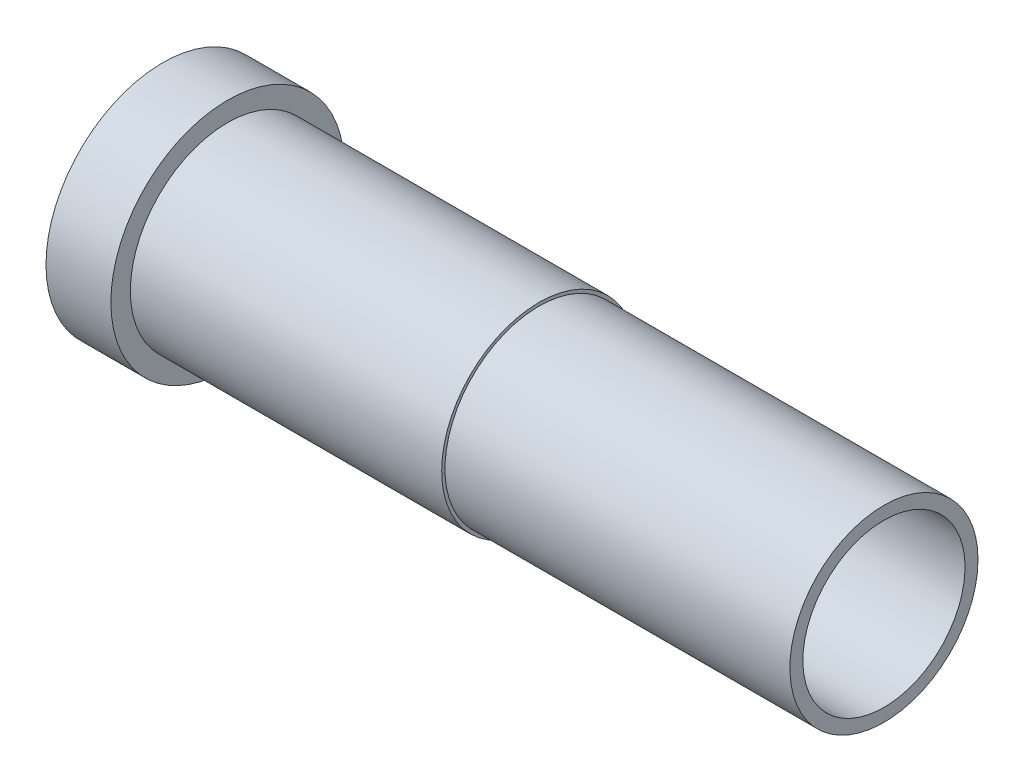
from build123d import *

# Parameters (mm, degrees)
CHANFREIN1_SIZE         = 0.5
ESQUISSE2_OUTSIDE_W     = 32.852
ESQUISSE2_OUTSIDE_H     = 32.852
ESQUISSE2_OUTSIDE_R     = 7.25
ENL_V_MAT_EXTRU_1_DEPTH = 30
ENL_V_START             = -3.4134
ESQUISSE3_R             = 7.25
ENL_V_MAT_EXTRU_2_DEPTH = 3.4134


with BuildPart() as part:
    # Esquisse1 → R_volution1 (revolve)
    with BuildSketch(Plane.XY, mode=Mode.PRIVATE) as r_volution1_sk:
        Polygon((0, 6.25), (0, 9), (5, 9), (5, 7.5), (59, 7.5), (59, 6.25), align=None)
    revolve(r_volution1_sk.sketch.rotate(Axis((-21.639335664, 0, 0), (1, 0, 0)), 90), axis=Axis((-21.639335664, 0, 0), (1, 0, 0)))

    # Chanfrein1
    chanfrein1_edges = [part.edges().sort_by_distance(p)[0] for p in [
        (0, 0, -6.25),
    ]]
    chamfer(chanfrein1_edges, length=CHANFREIN1_SIZE)

    # Esquisse2 outside → Enl_v. mat.-Extru.1 (cut)
    with BuildSketch(Plane(origin=(59, 0, 0), x_dir=(0, 0, -1), z_dir=(1, 0, 0))):
        Rectangle(ESQUISSE2_OUTSIDE_W, ESQUISSE2_OUTSIDE_H)
        Circle(ESQUISSE2_OUTSIDE_R, mode=Mode.SUBTRACT)
    extrude(amount=-ENL_V_MAT_EXTRU_1_DEPTH, mode=Mode.SUBTRACT)

    # Esquisse3 → Enl_v. mat.-Extru.2 (cut)
    with BuildSketch(Plane(origin=(59, 0, 0), x_dir=(0, 0, -1), z_dir=(1, 0, 0)).offset(ENL_V_START)):
        Circle(ESQUISSE3_R)
    extrude(amount=ENL_V_MAT_EXTRU_2_DEPTH, mode=Mode.SUBTRACT)


solid = part.part
